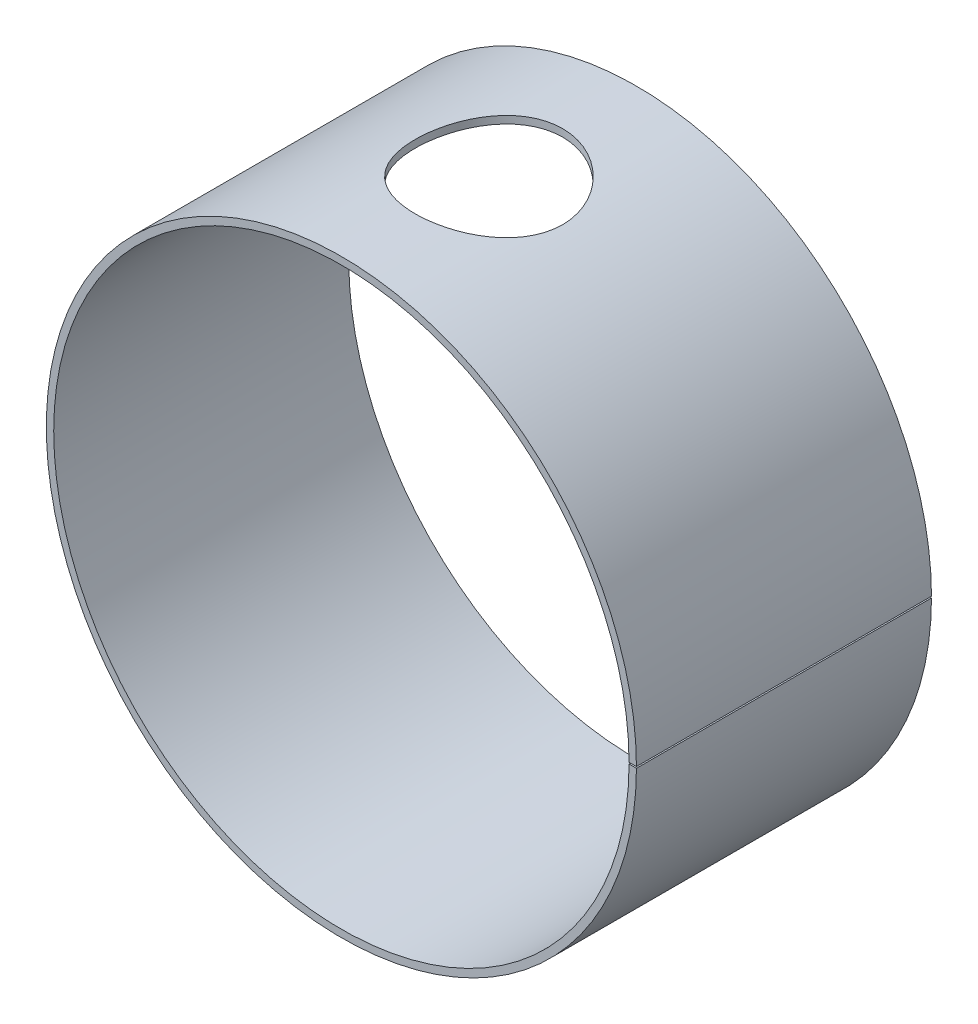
ISO-10303-21;
HEADER;
FILE_DESCRIPTION(('STEP AP214'),'2;1');
FILE_NAME('part.step','',(''),(''),'','','');
FILE_SCHEMA(('AUTOMOTIVE_DESIGN { 1 0 10303 214 1 1 1 1 }'));
ENDSEC;
DATA;
#1=APPLICATION_CONTEXT('core data for automotive mechanical design processes');
#2=APPLICATION_PROTOCOL_DEFINITION('international standard','automotive_design',2000,#1);
#3=PRODUCT_CONTEXT('',#1,'mechanical');
#4=PRODUCT('Part','Part','',(#3));
#5=PRODUCT_RELATED_PRODUCT_CATEGORY('part','',(#4));
#6=PRODUCT_DEFINITION_FORMATION('','',#4);
#7=PRODUCT_DEFINITION_CONTEXT('part definition',#1,'design');
#8=PRODUCT_DEFINITION('design','',#6,#7);
#9=PRODUCT_DEFINITION_SHAPE('','',#8);
#10=(LENGTH_UNIT() NAMED_UNIT(*) SI_UNIT(.MILLI.,.METRE.));
#11=(NAMED_UNIT(*) PLANE_ANGLE_UNIT() SI_UNIT($,.RADIAN.));
#12=(NAMED_UNIT(*) SI_UNIT($,.STERADIAN.) SOLID_ANGLE_UNIT());
#13=UNCERTAINTY_MEASURE_WITH_UNIT(LENGTH_MEASURE(1.E-05),#10,'distance_accuracy_value','');
#14=(GEOMETRIC_REPRESENTATION_CONTEXT(3) GLOBAL_UNCERTAINTY_ASSIGNED_CONTEXT((#13)) GLOBAL_UNIT_ASSIGNED_CONTEXT((#10,
#11,#12)) REPRESENTATION_CONTEXT('',''));
#15=CARTESIAN_POINT('',(0.,0.,0.));
#16=DIRECTION('',(0.,0.,1.));
#17=DIRECTION('',(1.,0.,0.));
#18=AXIS2_PLACEMENT_3D('',#15,#16,#17);
#19=CARTESIAN_POINT('',(0.,0.,291.200490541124));
#20=DIRECTION('',(0.,0.,-1.));
#21=DIRECTION('',(-1.,0.,0.));
#22=AXIS2_PLACEMENT_3D('',#19,#20,#21);
#23=CYLINDRICAL_SURFACE('',#22,40.);
#24=DIRECTION('',(0.,0.,-1.));
#25=VECTOR('',#24,1.);
#26=CARTESIAN_POINT('',(39.9998749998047,-0.0999999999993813,291.200490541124));
#27=LINE('',#26,#25);
#28=CARTESIAN_POINT('',(39.9998749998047,-0.0999999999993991,40.0000000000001));
#29=VERTEX_POINT('',#28);
#30=CARTESIAN_POINT('',(39.9998749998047,-0.0999999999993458,1.11022302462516E-13));
#31=VERTEX_POINT('',#30);
#32=EDGE_CURVE('E407',#29,#31,#27,.T.);
#33=ORIENTED_EDGE('',*,*,#32,.F.);
#34=CARTESIAN_POINT('',(0.,0.,40.0000000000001));
#35=DIRECTION('',(0.,0.,-1.));
#36=DIRECTION('',(-1.,0.,0.));
#37=AXIS2_PLACEMENT_3D('',#34,#35,#36);
#38=CIRCLE('',#37,40.);
#39=CARTESIAN_POINT('',(39.9998749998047,0.0999999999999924,40.0000000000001));
#40=VERTEX_POINT('',#39);
#41=EDGE_CURVE('E436',#40,#29,#38,.F.);
#42=ORIENTED_EDGE('',*,*,#41,.F.);
#43=DIRECTION('',(0.,0.,-1.));
#44=VECTOR('',#43,1.);
#45=CARTESIAN_POINT('',(39.9998749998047,0.0999999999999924,291.200490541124));
#46=LINE('',#45,#44);
#47=CARTESIAN_POINT('',(39.9998749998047,0.0999999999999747,1.11022302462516E-13));
#48=VERTEX_POINT('',#47);
#49=EDGE_CURVE('E427',#48,#40,#46,.F.);
#50=ORIENTED_EDGE('',*,*,#49,.F.);
#51=CARTESIAN_POINT('',(0.,0.,1.11022302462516E-13));
#52=DIRECTION('',(0.,0.,-1.));
#53=DIRECTION('',(-1.,0.,0.));
#54=AXIS2_PLACEMENT_3D('',#51,#52,#53);
#55=CIRCLE('',#54,40.);
#56=EDGE_CURVE('E425',#31,#48,#55,.T.);
#57=ORIENTED_EDGE('',*,*,#56,.F.);
#58=EDGE_LOOP('',(#33,#42,#50,#57));
#59=FACE_BOUND('',#58,.T.);
#60=CARTESIAN_POINT('',(10.,38.7298334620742,20.));
#61=CARTESIAN_POINT('',(9.99999882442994,38.7298341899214,20.2761247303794));
#62=CARTESIAN_POINT('',(9.98855350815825,38.7327944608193,20.5522729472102));
#63=CARTESIAN_POINT('',(9.94286631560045,38.7445474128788,21.1025695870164));
#64=CARTESIAN_POINT('',(9.90862182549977,38.7533407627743,21.3767177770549));
#65=CARTESIAN_POINT('',(9.81760607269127,38.7764982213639,21.9211501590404));
#66=CARTESIAN_POINT('',(9.76082365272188,38.7908650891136,22.1914323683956));
#67=CARTESIAN_POINT('',(9.62520453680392,38.8247384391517,22.7260782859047));
#68=CARTESIAN_POINT('',(9.5463672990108,38.844245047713,22.9904418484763));
#69=CARTESIAN_POINT('',(9.36739293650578,38.887792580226,23.5110713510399));
#70=CARTESIAN_POINT('',(9.26728433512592,38.9118274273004,23.7673476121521));
#71=CARTESIAN_POINT('',(9.04647193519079,38.963754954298,24.2704587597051));
#72=CARTESIAN_POINT('',(8.92576802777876,38.9916476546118,24.5172935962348));
#73=CARTESIAN_POINT('',(8.6646679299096,39.0504984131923,24.9998784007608));
#74=CARTESIAN_POINT('',(8.5242749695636,39.081455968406,25.2356301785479));
#75=CARTESIAN_POINT('',(8.22470570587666,39.1455959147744,25.6946784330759));
#76=CARTESIAN_POINT('',(8.06552267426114,39.1787791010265,25.9179704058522));
#77=CARTESIAN_POINT('',(7.72620281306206,39.2471185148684,26.3548220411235));
#78=CARTESIAN_POINT('',(7.54571867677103,39.2823005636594,26.5681079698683));
#79=CARTESIAN_POINT('',(7.16749556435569,39.3530688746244,26.9788963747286));
#80=CARTESIAN_POINT('',(6.96974874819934,39.3886553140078,27.1763916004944));
#81=CARTESIAN_POINT('',(6.55834550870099,39.4592404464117,27.5542114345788));
#82=CARTESIAN_POINT('',(6.34468754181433,39.4942390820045,27.7345343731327));
#83=CARTESIAN_POINT('',(5.90296918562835,39.5626701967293,28.0766927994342));
#84=CARTESIAN_POINT('',(5.67491535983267,39.5961033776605,28.2385366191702));
#85=CARTESIAN_POINT('',(5.20241798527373,39.6609696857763,28.544896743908));
#86=CARTESIAN_POINT('',(4.95778544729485,39.6923669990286,28.6891293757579));
#87=CARTESIAN_POINT('',(4.45690914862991,39.7517235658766,28.956366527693));
#88=CARTESIAN_POINT('',(4.20066995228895,39.7796841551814,29.0793793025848));
#89=CARTESIAN_POINT('',(3.67826123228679,39.8313856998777,29.3032876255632));
#90=CARTESIAN_POINT('',(3.41209084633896,39.8551262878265,29.4041812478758));
#91=CARTESIAN_POINT('',(2.87176268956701,39.8976992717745,29.5830035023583));
#92=CARTESIAN_POINT('',(2.59760510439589,39.916531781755,29.6609326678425));
#93=CARTESIAN_POINT('',(2.04895085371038,39.9484139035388,29.7918190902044));
#94=CARTESIAN_POINT('',(1.77457355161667,39.9615729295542,29.8452502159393));
#95=CARTESIAN_POINT('',(1.22210094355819,39.9822820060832,29.9289739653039));
#96=CARTESIAN_POINT('',(0.944005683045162,39.9898321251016,29.9592668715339));
#97=CARTESIAN_POINT('',(0.386193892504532,39.9991081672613,29.9964483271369));
#98=CARTESIAN_POINT('',(0.106477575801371,40.0008348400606,30.0033398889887));
#99=CARTESIAN_POINT('',(-0.452521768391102,39.9984167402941,29.993666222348));
#100=CARTESIAN_POINT('',(-0.73180480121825,39.9942720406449,29.977101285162));
#101=CARTESIAN_POINT('',(-1.28167192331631,39.9803861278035,29.9212893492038));
#102=CARTESIAN_POINT('',(-1.55231139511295,39.970771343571,29.8825546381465));
#103=CARTESIAN_POINT('',(-2.08927819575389,39.9463033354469,29.7831216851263));
#104=CARTESIAN_POINT('',(-2.35560559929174,39.9314502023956,29.7224238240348));
#105=CARTESIAN_POINT('',(-2.88207226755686,39.8969077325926,29.5795639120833));
#106=CARTESIAN_POINT('',(-3.14221243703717,39.8772191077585,29.4974050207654));
#107=CARTESIAN_POINT('',(-3.65468922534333,39.8335212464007,29.3122235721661));
#108=CARTESIAN_POINT('',(-3.90702288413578,39.8095103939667,29.2091932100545));
#109=CARTESIAN_POINT('',(-4.40431534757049,39.7575786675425,28.9820591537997));
#110=CARTESIAN_POINT('',(-4.64918953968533,39.7296251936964,28.8577777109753));
#111=CARTESIAN_POINT('',(-5.12762994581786,39.670713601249,28.5896805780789));
#112=CARTESIAN_POINT('',(-5.36119566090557,39.6397553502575,28.4458640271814));
#113=CARTESIAN_POINT('',(-5.81555504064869,39.5756487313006,28.1396791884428));
#114=CARTESIAN_POINT('',(-6.03634710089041,39.54250008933,27.9773085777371));
#115=CARTESIAN_POINT('',(-6.4637475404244,39.4748880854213,27.6351106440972));
#116=CARTESIAN_POINT('',(-6.67035566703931,39.440424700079,27.4552830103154));
#117=CARTESIAN_POINT('',(-7.07349089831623,39.3701501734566,27.0742295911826));
#118=CARTESIAN_POINT('',(-7.26959292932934,39.3343278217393,26.8725559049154));
#119=CARTESIAN_POINT('',(-7.64415900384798,39.2632548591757,26.4533588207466));
#120=CARTESIAN_POINT('',(-7.82262331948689,39.228004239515,26.2358356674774));
#121=CARTESIAN_POINT('',(-8.16074569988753,39.1590604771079,25.786307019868));
#122=CARTESIAN_POINT('',(-8.32039882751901,39.1253677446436,25.5542977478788));
#123=CARTESIAN_POINT('',(-8.61965464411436,39.0605298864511,25.0774748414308));
#124=CARTESIAN_POINT('',(-8.75926505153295,39.0293837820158,24.8326661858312));
#125=CARTESIAN_POINT('',(-9.01813008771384,38.9703868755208,24.3305332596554));
#126=CARTESIAN_POINT('',(-9.13727778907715,38.9425536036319,24.0731517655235));
#127=CARTESIAN_POINT('',(-9.35340966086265,38.8912082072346,23.5488215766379));
#128=CARTESIAN_POINT('',(-9.45039369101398,38.8676961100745,23.2818728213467));
#129=CARTESIAN_POINT('',(-9.6213797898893,38.8257235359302,22.7403739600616));
#130=CARTESIAN_POINT('',(-9.69538588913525,38.8072621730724,22.4658251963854));
#131=CARTESIAN_POINT('',(-9.81979727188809,38.7759681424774,21.9111173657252));
#132=CARTESIAN_POINT('',(-9.87020317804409,38.7631353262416,21.6309584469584));
#133=CARTESIAN_POINT('',(-9.94595070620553,38.7437678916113,21.0746101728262));
#134=CARTESIAN_POINT('',(-9.97191943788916,38.7370758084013,20.7985115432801));
#135=CARTESIAN_POINT('',(-10.0008373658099,38.7296201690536,20.2450332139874));
#136=CARTESIAN_POINT('',(-10.0037869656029,38.7288565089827,19.9676535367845));
#137=CARTESIAN_POINT('',(-9.9866420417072,38.7332810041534,19.4136800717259));
#138=CARTESIAN_POINT('',(-9.96654947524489,38.7384686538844,19.1370862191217));
#139=CARTESIAN_POINT('',(-9.90349851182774,38.7546355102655,18.5866903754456));
#140=CARTESIAN_POINT('',(-9.86054021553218,38.7656146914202,18.3128883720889));
#141=CARTESIAN_POINT('',(-9.75302617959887,38.7928020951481,17.7745633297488));
#142=CARTESIAN_POINT('',(-9.6888404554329,38.808920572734,17.5099617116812));
#143=CARTESIAN_POINT('',(-9.53919991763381,38.8459727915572,16.9870878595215));
#144=CARTESIAN_POINT('',(-9.45373745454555,38.8669082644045,16.7288179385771));
#145=CARTESIAN_POINT('',(-9.26222456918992,38.9129912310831,16.2204540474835));
#146=CARTESIAN_POINT('',(-9.15617645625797,38.938138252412,15.9703591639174));
#147=CARTESIAN_POINT('',(-8.92426167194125,38.9919442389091,15.4799182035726));
#148=CARTESIAN_POINT('',(-8.79839403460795,39.020603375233,15.2395726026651));
#149=CARTESIAN_POINT('',(-8.52507025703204,39.0812377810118,14.7655480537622));
#150=CARTESIAN_POINT('',(-8.37723937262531,39.113267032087,14.5320920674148));
#151=CARTESIAN_POINT('',(-8.0629212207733,39.1792684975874,14.0783899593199));
#152=CARTESIAN_POINT('',(-7.89643375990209,39.213240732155,13.8581439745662));
#153=CARTESIAN_POINT('',(-7.54588651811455,39.2822033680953,13.432224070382));
#154=CARTESIAN_POINT('',(-7.3618240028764,39.3171939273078,13.2265524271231));
#155=CARTESIAN_POINT('',(-6.97734499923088,39.3872419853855,12.8311295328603));
#156=CARTESIAN_POINT('',(-6.77692868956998,39.4222994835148,12.6413781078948));
#157=CARTESIAN_POINT('',(-6.35575426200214,39.492418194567,12.2744352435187));
#158=CARTESIAN_POINT('',(-6.13461012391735,39.5274571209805,12.0976822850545));
#159=CARTESIAN_POINT('',(-5.67802548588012,39.5956219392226,11.76349371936));
#160=CARTESIAN_POINT('',(-5.44259023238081,39.6287485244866,11.6060510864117));
#161=CARTESIAN_POINT('',(-4.9588919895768,39.6921766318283,11.311526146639));
#162=CARTESIAN_POINT('',(-4.71062694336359,39.7224776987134,11.1744471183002));
#163=CARTESIAN_POINT('',(-4.20300973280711,39.7793907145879,10.9217242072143));
#164=CARTESIAN_POINT('',(-3.94365773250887,39.8060027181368,10.8060800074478));
#165=CARTESIAN_POINT('',(-3.41762467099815,39.8545993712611,10.5979116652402));
#166=CARTESIAN_POINT('',(-3.15101114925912,39.8766164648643,10.505224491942));
#167=CARTESIAN_POINT('',(-2.6105610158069,39.9156405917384,10.3426402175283));
#168=CARTESIAN_POINT('',(-2.33672441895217,39.9326476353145,10.2727430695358));
#169=CARTESIAN_POINT('',(-1.78388474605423,39.9611605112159,10.1563453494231));
#170=CARTESIAN_POINT('',(-1.50488250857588,39.9726672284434,10.1098410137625));
#171=CARTESIAN_POINT('',(-0.943766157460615,39.989849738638,10.0406219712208));
#172=CARTESIAN_POINT('',(-0.661652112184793,39.9955256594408,10.0179067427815));
#173=CARTESIAN_POINT('',(-0.104112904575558,40.0008096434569,9.99675707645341));
#174=CARTESIAN_POINT('',(0.171286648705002,40.0005777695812,9.99768214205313));
#175=CARTESIAN_POINT('',(0.721004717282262,39.9944459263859,10.022232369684));
#176=CARTESIAN_POINT('',(0.995323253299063,39.9885460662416,10.0458570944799));
#177=CARTESIAN_POINT('',(1.54089668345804,39.9712412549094,10.1156049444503));
#178=CARTESIAN_POINT('',(1.8121516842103,39.9598364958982,10.1617272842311));
#179=CARTESIAN_POINT('',(2.34968444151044,39.9318346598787,10.276086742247));
#180=CARTESIAN_POINT('',(2.61596217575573,39.9152375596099,10.3443239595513));
#181=CARTESIAN_POINT('',(3.14021575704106,39.8774088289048,10.5019187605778));
#182=CARTESIAN_POINT('',(3.39822973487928,39.8562036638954,10.591155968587));
#183=CARTESIAN_POINT('',(3.90587165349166,39.8096616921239,10.7903021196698));
#184=CARTESIAN_POINT('',(4.15549652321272,39.7843233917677,10.9002185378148));
#185=CARTESIAN_POINT('',(4.644612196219,39.7301915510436,11.1398792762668));
#186=CARTESIAN_POINT('',(4.88410403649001,39.7013983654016,11.2696215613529));
#187=CARTESIAN_POINT('',(5.35147219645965,39.6411058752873,11.5480334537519));
#188=CARTESIAN_POINT('',(5.57934796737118,39.6096064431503,11.6967039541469));
#189=CARTESIAN_POINT('',(6.02736320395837,39.5439423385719,12.01574564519));
#190=CARTESIAN_POINT('',(6.24718667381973,39.5097319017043,12.1865512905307));
#191=CARTESIAN_POINT('',(6.67174267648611,39.4402602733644,12.5457945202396));
#192=CARTESIAN_POINT('',(6.87647499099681,39.404999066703,12.7342323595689));
#193=CARTESIAN_POINT('',(7.26957571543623,39.3343764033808,13.1275481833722));
#194=CARTESIAN_POINT('',(7.45793992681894,39.2990149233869,13.3324303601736));
#195=CARTESIAN_POINT('',(7.81700480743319,39.2291715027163,13.7572612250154));
#196=CARTESIAN_POINT('',(7.98770582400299,39.1946895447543,13.9772096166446));
#197=CARTESIAN_POINT('',(8.3133483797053,39.1269271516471,14.4350529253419));
#198=CARTESIAN_POINT('',(8.4679310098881,39.0936817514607,14.6732084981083));
#199=CARTESIAN_POINT('',(8.75638447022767,39.0300851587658,15.1620014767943));
#200=CARTESIAN_POINT('',(8.89026288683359,38.9997329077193,15.4126342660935));
#201=CARTESIAN_POINT('',(9.13629742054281,38.9428300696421,15.9246223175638));
#202=CARTESIAN_POINT('',(9.24846310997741,38.9162778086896,16.1859727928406));
#203=CARTESIAN_POINT('',(9.45023169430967,38.8677746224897,16.7176328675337));
#204=CARTESIAN_POINT('',(9.53983802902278,38.8458229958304,16.9879410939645));
#205=CARTESIAN_POINT('',(9.68099536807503,38.8108560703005,17.483727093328));
#206=CARTESIAN_POINT('',(9.73653858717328,38.7969358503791,17.7080140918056));
#207=CARTESIAN_POINT('',(9.83199198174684,38.7728560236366,18.1600842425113));
#208=CARTESIAN_POINT('',(9.87190326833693,38.7626961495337,18.3878671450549));
#209=CARTESIAN_POINT('',(9.93585968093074,38.746351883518,18.8458127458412));
#210=CARTESIAN_POINT('',(9.95990338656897,38.7401678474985,19.0759756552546));
#211=CARTESIAN_POINT('',(9.99197195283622,38.7319088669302,19.5374204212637));
#212=CARTESIAN_POINT('',(10.0000009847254,38.7298328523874,19.7687019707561));
#213=CARTESIAN_POINT('',(10.,38.7298334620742,20.));
#214=B_SPLINE_CURVE_WITH_KNOTS('',3,(#60,#61,#62,#63,#64,#65,#66,#67,#68,#69,#70,#71,#72,#73,
#74,#75,#76,#77,#78,#79,#80,#81,#82,#83,#84,#85,#86,#87,#88,#89,#90,#91,#92,#93,#94,#95,#96,#97,
#98,#99,#100,#101,#102,#103,#104,#105,#106,#107,#108,#109,#110,#111,#112,#113,#114,#115,#116,
#117,#118,#119,#120,#121,#122,#123,#124,#125,#126,#127,#128,#129,#130,#131,#132,#133,#134,#135,
#136,#137,#138,#139,#140,#141,#142,#143,#144,#145,#146,#147,#148,#149,#150,#151,#152,#153,#154,
#155,#156,#157,#158,#159,#160,#161,#162,#163,#164,#165,#166,#167,#168,#169,#170,#171,#172,#173,
#174,#175,#176,#177,#178,#179,#180,#181,#182,#183,#184,#185,#186,#187,#188,#189,#190,#191,#192,
#193,#194,#195,#196,#197,#198,#199,#200,#201,#202,#203,#204,#205,#206,#207,#208,#209,#210,#211,
#212,#213),.UNSPECIFIED.,.T.,.F.,(4,2,2,2,2,2,2,2,2,2,2,2,2,2,2,2,2,2,2,2,2,2,2,2,2,2,2,2,2,2,2,
2,2,2,2,2,2,2,2,2,2,2,2,2,2,2,2,2,2,2,2,2,2,2,2,2,2,2,2,2,2,2,2,2,2,2,2,2,2,2,2,2,2,2,2,2,4),
(0.,0.828162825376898,1.656420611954,2.48508893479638,3.31377761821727,4.14136202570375,
4.96895080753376,5.79640397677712,6.6241543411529,7.4680030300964,8.31223697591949,
9.15655292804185,10.0004866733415,10.8565959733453,11.7123714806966,12.5682214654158,
13.4240515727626,14.2625454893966,15.1010291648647,15.9394048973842,16.7777702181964,
17.5975029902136,18.4172215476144,19.2368194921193,20.0567244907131,20.8838566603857,
21.7110252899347,22.5382975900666,23.3655846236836,24.2152966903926,25.0649956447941,
25.9149171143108,26.7645103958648,27.6184163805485,28.472327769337,29.32608929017,
30.1798282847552,31.0110078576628,31.8421728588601,32.6732672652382,33.5043580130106,
34.3216649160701,35.1392660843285,35.9567755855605,36.7743249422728,37.6078964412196,
38.4414765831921,39.2751866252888,40.108887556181,40.9636530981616,41.8181067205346,
42.6726977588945,43.527276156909,44.3755994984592,45.2239210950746,46.0721061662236,
46.9202726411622,47.7454843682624,48.5706802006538,49.395847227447,50.2210179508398,
51.0415691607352,51.8624175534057,52.6831817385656,53.5039846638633,54.3444458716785,
55.1849192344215,56.0256075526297,56.8662793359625,57.7228427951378,58.5790916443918,
59.4349621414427,60.2907020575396,60.9845870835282,61.6784227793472,62.3723205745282,
63.066037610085),.UNSPECIFIED.);
#215=CARTESIAN_POINT('',(10.,38.7298334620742,20.));
#216=VERTEX_POINT('',#215);
#217=EDGE_CURVE('E419',#216,#216,#214,.T.);
#218=ORIENTED_EDGE('',*,*,#217,.T.);
#219=EDGE_LOOP('',(#218));
#220=FACE_BOUND('',#219,.T.);
#221=ADVANCED_FACE('F358',(#59,#220),#23,.T.);
#222=CARTESIAN_POINT('',(0.,0.,291.200490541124));
#223=DIRECTION('',(0.,0.,-1.));
#224=DIRECTION('',(-1.,0.,0.));
#225=AXIS2_PLACEMENT_3D('',#222,#223,#224);
#226=CYLINDRICAL_SURFACE('',#225,39.);
#227=DIRECTION('',(0.,0.,-1.));
#228=VECTOR('',#227,1.);
#229=CARTESIAN_POINT('',(38.9998781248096,-0.0974999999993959,291.200490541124));
#230=LINE('',#229,#228);
#231=CARTESIAN_POINT('',(38.9998781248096,-0.0974999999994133,40.0000000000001));
#232=VERTEX_POINT('',#231);
#233=CARTESIAN_POINT('',(38.9998781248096,-0.0974999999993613,1.11022302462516E-13));
#234=VERTEX_POINT('',#233);
#235=EDGE_CURVE('E405',#232,#234,#230,.T.);
#236=ORIENTED_EDGE('',*,*,#235,.T.);
#237=CARTESIAN_POINT('',(0.,0.,1.11022302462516E-13));
#238=DIRECTION('',(0.,0.,-1.));
#239=DIRECTION('',(-1.,0.,0.));
#240=AXIS2_PLACEMENT_3D('',#237,#238,#239);
#241=CIRCLE('',#240,39.);
#242=CARTESIAN_POINT('',(38.9998781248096,0.0974999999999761,1.11022302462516E-13));
#243=VERTEX_POINT('',#242);
#244=EDGE_CURVE('E413',#234,#243,#241,.T.);
#245=ORIENTED_EDGE('',*,*,#244,.T.);
#246=DIRECTION('',(0.,0.,-1.));
#247=VECTOR('',#246,1.);
#248=CARTESIAN_POINT('',(38.9998781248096,0.0974999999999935,291.200490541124));
#249=LINE('',#248,#247);
#250=CARTESIAN_POINT('',(38.9998781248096,0.0974999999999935,40.0000000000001));
#251=VERTEX_POINT('',#250);
#252=EDGE_CURVE('E418',#243,#251,#249,.F.);
#253=ORIENTED_EDGE('',*,*,#252,.T.);
#254=CARTESIAN_POINT('',(0.,0.,40.0000000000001));
#255=DIRECTION('',(0.,0.,-1.));
#256=DIRECTION('',(-1.,0.,0.));
#257=AXIS2_PLACEMENT_3D('',#254,#255,#256);
#258=CIRCLE('',#257,39.);
#259=EDGE_CURVE('E424',#251,#232,#258,.F.);
#260=ORIENTED_EDGE('',*,*,#259,.T.);
#261=EDGE_LOOP('',(#236,#245,#253,#260));
#262=FACE_BOUND('',#261,.T.);
#263=CARTESIAN_POINT('',(10.,37.6961536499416,20.));
#264=CARTESIAN_POINT('',(9.9999988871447,37.6961543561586,20.2758740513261));
#265=CARTESIAN_POINT('',(9.98857429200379,37.6991903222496,20.5517699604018));
#266=CARTESIAN_POINT('',(9.94297112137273,37.711243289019,21.1015592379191));
#267=CARTESIAN_POINT('',(9.90879011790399,37.7202609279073,21.3754523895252));
#268=CARTESIAN_POINT('',(9.81794749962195,37.7440075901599,21.9193652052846));
#269=CARTESIAN_POINT('',(9.76127537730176,37.7587392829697,22.189382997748));
#270=CARTESIAN_POINT('',(9.62592579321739,37.7934706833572,22.7235011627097));
#271=CARTESIAN_POINT('',(9.54724777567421,37.813470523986,22.9876013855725));
#272=CARTESIAN_POINT('',(9.3686471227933,37.8581154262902,23.5076984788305));
#273=CARTESIAN_POINT('',(9.26875389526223,37.8827540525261,23.7637060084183));
#274=CARTESIAN_POINT('',(9.04842686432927,37.9359830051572,24.2662933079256));
#275=CARTESIAN_POINT('',(8.92799296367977,37.9645733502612,24.5128730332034));
#276=CARTESIAN_POINT('',(8.66748503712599,38.0248940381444,24.9949739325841));
#277=CARTESIAN_POINT('',(8.52741399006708,38.0566239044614,25.2304967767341));
#278=CARTESIAN_POINT('',(8.22853874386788,38.1223630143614,25.6891207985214));
#279=CARTESIAN_POINT('',(8.06972782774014,38.156373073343,25.9122174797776));
#280=CARTESIAN_POINT('',(7.73102984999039,38.2264526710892,26.3489442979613));
#281=CARTESIAN_POINT('',(7.5507776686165,38.2625501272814,26.562286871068));
#282=CARTESIAN_POINT('',(7.17302175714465,38.3351634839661,26.9732120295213));
#283=CARTESIAN_POINT('',(6.97551018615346,38.3716795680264,27.1707873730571));
#284=CARTESIAN_POINT('',(6.56457254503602,38.4441141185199,27.5487968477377));
#285=CARTESIAN_POINT('',(6.35114486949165,38.4800325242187,27.7292292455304));
#286=CARTESIAN_POINT('',(5.90987445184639,38.5502693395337,28.0716379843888));
#287=CARTESIAN_POINT('',(5.68203827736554,38.5845884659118,28.2336226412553));
#288=CARTESIAN_POINT('',(5.20977554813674,38.6512089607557,28.5404171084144));
#289=CARTESIAN_POINT('',(4.96514940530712,38.6834717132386,28.6849283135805));
#290=CARTESIAN_POINT('',(4.46423990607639,38.7444729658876,28.9527194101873));
#291=CARTESIAN_POINT('',(4.20796114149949,38.773212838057,29.07600757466));
#292=CARTESIAN_POINT('',(3.68542692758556,38.8263646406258,29.3004563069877));
#293=CARTESIAN_POINT('',(3.41917066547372,38.8507762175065,29.4016150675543));
#294=CARTESIAN_POINT('',(2.87862488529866,38.8945630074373,29.5809498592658));
#295=CARTESIAN_POINT('',(2.60433556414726,38.9139383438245,29.6591264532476));
#296=CARTESIAN_POINT('',(2.0556582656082,38.9467352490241,29.7904106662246));
#297=CARTESIAN_POINT('',(1.78139635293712,38.9602746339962,29.8440159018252));
#298=CARTESIAN_POINT('',(1.22912862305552,38.981605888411,29.9281043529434));
#299=CARTESIAN_POINT('',(0.951122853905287,38.9893978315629,29.9585878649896));
#300=CARTESIAN_POINT('',(0.393469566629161,38.9990120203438,29.99616272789));
#301=CARTESIAN_POINT('',(0.113822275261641,39.0008350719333,30.0032572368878));
#302=CARTESIAN_POINT('',(-0.445056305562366,38.9984616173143,29.9939996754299));
#303=CARTESIAN_POINT('',(-0.724287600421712,38.9942651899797,29.9776479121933));
#304=CARTESIAN_POINT('',(-1.27374604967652,38.9801402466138,29.922299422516));
#305=CARTESIAN_POINT('',(-1.54403112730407,38.9703479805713,29.8838408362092));
#306=CARTESIAN_POINT('',(-2.08030944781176,38.945402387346,29.7850217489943));
#307=CARTESIAN_POINT('',(-2.34630276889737,38.9302491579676,29.7246616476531));
#308=CARTESIAN_POINT('',(-2.87212632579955,38.8949909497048,29.5825390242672));
#309=CARTESIAN_POINT('',(-3.13195745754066,38.8748866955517,29.500779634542));
#310=CARTESIAN_POINT('',(-3.64384697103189,38.8302513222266,29.3164591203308));
#311=CARTESIAN_POINT('',(-3.89590240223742,38.8057185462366,29.2138902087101));
#312=CARTESIAN_POINT('',(-4.39276091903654,38.7526341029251,28.9877049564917));
#313=CARTESIAN_POINT('',(-4.63747639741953,38.7240476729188,28.863904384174));
#314=CARTESIAN_POINT('',(-5.11564042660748,38.6637854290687,28.5968147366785));
#315=CARTESIAN_POINT('',(-5.34908846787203,38.6321094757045,28.453524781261));
#316=CARTESIAN_POINT('',(-5.80326396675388,38.5664982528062,28.1484339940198));
#317=CARTESIAN_POINT('',(-6.02398974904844,38.5325626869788,27.9866307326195));
#318=CARTESIAN_POINT('',(-6.45131741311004,38.4633249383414,27.6456023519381));
#319=CARTESIAN_POINT('',(-6.65791903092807,38.4280227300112,27.4663769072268));
#320=CARTESIAN_POINT('',(-7.06138475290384,38.3559647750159,27.0863123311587));
#321=CARTESIAN_POINT('',(-7.25780390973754,38.319196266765,26.8850029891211));
#322=CARTESIAN_POINT('',(-7.63303689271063,38.2462192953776,26.4665085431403));
#323=CARTESIAN_POINT('',(-7.81185098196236,38.210010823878,26.2493236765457));
#324=CARTESIAN_POINT('',(-8.15070826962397,38.1391653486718,25.8004357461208));
#325=CARTESIAN_POINT('',(-8.31074643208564,38.1045287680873,25.5687288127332));
#326=CARTESIAN_POINT('',(-8.6108051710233,38.0378450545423,25.0924667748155));
#327=CARTESIAN_POINT('',(-8.75083346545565,38.0057969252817,24.8479166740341));
#328=CARTESIAN_POINT('',(-9.01062817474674,37.9450456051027,24.3461293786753));
#329=CARTESIAN_POINT('',(-9.13027766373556,37.9163619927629,24.0888292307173));
#330=CARTESIAN_POINT('',(-9.34741454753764,37.8634169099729,23.5645942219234));
#331=CARTESIAN_POINT('',(-9.4449017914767,37.8391554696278,23.297659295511));
#332=CARTESIAN_POINT('',(-9.6168850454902,37.7958118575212,22.7561232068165));
#333=CARTESIAN_POINT('',(-9.69138532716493,37.7767287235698,22.4815234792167));
#334=CARTESIAN_POINT('',(-9.81676694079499,37.7443411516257,21.9266501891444));
#335=CARTESIAN_POINT('',(-9.86764893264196,37.7310365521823,21.646376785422));
#336=CARTESIAN_POINT('',(-9.94425798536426,37.7109169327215,21.0901184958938));
#337=CARTESIAN_POINT('',(-9.97064366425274,37.703932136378,20.8142303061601));
#338=CARTESIAN_POINT('',(-10.0004253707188,37.6960440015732,20.2611308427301));
#339=CARTESIAN_POINT('',(-10.0038218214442,37.6951405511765,19.9839195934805));
#340=CARTESIAN_POINT('',(-9.98759627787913,37.6994428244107,19.4302456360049));
#341=CARTESIAN_POINT('',(-9.96797634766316,37.7046480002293,19.1537828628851));
#342=CARTESIAN_POINT('',(-9.90589423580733,37.7210059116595,18.6036141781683));
#343=CARTESIAN_POINT('',(-9.86343216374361,37.7321586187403,18.3299082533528));
#344=CARTESIAN_POINT('',(-9.75698219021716,37.759823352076,17.7920298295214));
#345=CARTESIAN_POINT('',(-9.6933873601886,37.7762373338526,17.527774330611));
#346=CARTESIAN_POINT('',(-9.54499662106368,37.8140039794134,17.0055464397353));
#347=CARTESIAN_POINT('',(-9.46019309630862,37.8353584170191,16.7475763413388));
#348=CARTESIAN_POINT('',(-9.27006360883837,37.8823903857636,16.2397577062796));
#349=CARTESIAN_POINT('',(-9.16473988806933,37.9080674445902,15.9899082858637));
#350=CARTESIAN_POINT('',(-8.93433628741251,37.9630300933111,15.4998953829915));
#351=CARTESIAN_POINT('',(-8.80925541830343,37.992315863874,15.2597323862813));
#352=CARTESIAN_POINT('',(-8.53745710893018,38.0543249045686,14.7857914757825));
#353=CARTESIAN_POINT('',(-8.39034871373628,38.0871063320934,14.5522453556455));
#354=CARTESIAN_POINT('',(-8.07749479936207,38.1546809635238,14.0982995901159));
#355=CARTESIAN_POINT('',(-7.91174907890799,38.1894741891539,13.8779000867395));
#356=CARTESIAN_POINT('',(-7.56269531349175,38.2601273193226,13.4515998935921));
#357=CARTESIAN_POINT('',(-7.37938440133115,38.2959873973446,13.2457015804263));
#358=CARTESIAN_POINT('',(-6.99640905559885,38.3678017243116,12.8497465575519));
#359=CARTESIAN_POINT('',(-6.79674478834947,38.4037559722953,12.6596896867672));
#360=CARTESIAN_POINT('',(-6.37677976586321,38.4757489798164,12.2917786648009));
#361=CARTESIAN_POINT('',(-6.15607015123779,38.5117643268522,12.1143862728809));
#362=CARTESIAN_POINT('',(-5.70028820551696,38.5818590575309,11.7788832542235));
#363=CARTESIAN_POINT('',(-5.46522113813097,38.615939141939,11.620765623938));
#364=CARTESIAN_POINT('',(-4.98218476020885,38.6812258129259,11.3248592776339));
#365=CARTESIAN_POINT('',(-4.7342133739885,38.7124319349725,11.1870738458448));
#366=CARTESIAN_POINT('',(-4.22710231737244,38.7710812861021,10.9329143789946));
#367=CARTESIAN_POINT('',(-3.96796281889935,38.7985245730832,10.8165400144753));
#368=CARTESIAN_POINT('',(-3.44230162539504,38.8486774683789,10.6069160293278));
#369=CARTESIAN_POINT('',(-3.17584927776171,38.8714208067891,10.5135006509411));
#370=CARTESIAN_POINT('',(-2.6356378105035,38.9117818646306,10.3494510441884));
#371=CARTESIAN_POINT('',(-2.36187870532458,38.9293995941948,10.2788167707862));
#372=CARTESIAN_POINT('',(-1.80911481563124,38.9590001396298,10.1609477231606));
#373=CARTESIAN_POINT('',(-1.53011092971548,38.9709839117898,10.1137089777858));
#374=CARTESIAN_POINT('',(-0.968915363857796,38.9889729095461,10.0430335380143));
#375=CARTESIAN_POINT('',(-0.686723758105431,38.9949782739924,10.0195962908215));
#376=CARTESIAN_POINT('',(-0.129353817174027,39.0007529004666,9.9970585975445));
#377=CARTESIAN_POINT('',(0.145795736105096,39.0006946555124,9.99728498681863));
#378=CARTESIAN_POINT('',(0.695074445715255,38.9947727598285,10.0203993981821));
#379=CARTESIAN_POINT('',(0.969203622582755,38.9889092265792,10.0432869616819));
#380=CARTESIAN_POINT('',(1.51445710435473,38.9715386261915,10.111526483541));
#381=CARTESIAN_POINT('',(1.78558152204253,38.9600317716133,10.1568775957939));
#382=CARTESIAN_POINT('',(2.32291190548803,38.9316897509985,10.2696637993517));
#383=CARTESIAN_POINT('',(2.58911784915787,38.9148545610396,10.3370989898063));
#384=CARTESIAN_POINT('',(3.11314293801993,38.8764317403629,10.4930229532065));
#385=CARTESIAN_POINT('',(3.3710035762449,38.8548739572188,10.5813797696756));
#386=CARTESIAN_POINT('',(3.878409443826,38.8075108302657,10.7787165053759));
#387=CARTESIAN_POINT('',(4.12795163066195,38.7817039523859,10.8877038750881));
#388=CARTESIAN_POINT('',(4.61698015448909,38.7265289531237,11.1254629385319));
#389=CARTESIAN_POINT('',(4.85646748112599,38.6971611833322,11.2542326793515));
#390=CARTESIAN_POINT('',(5.32391187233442,38.6356253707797,11.5306612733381));
#391=CARTESIAN_POINT('',(5.55186837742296,38.6034571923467,11.6783210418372));
#392=CARTESIAN_POINT('',(6.00037219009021,38.5363235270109,11.9954490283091));
#393=CARTESIAN_POINT('',(6.22059200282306,38.5013082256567,12.1653700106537));
#394=CARTESIAN_POINT('',(6.64601690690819,38.4301572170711,12.5228575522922));
#395=CARTESIAN_POINT('',(6.85122177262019,38.3940214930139,12.7104243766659));
#396=CARTESIAN_POINT('',(7.24534953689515,38.321600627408,13.1020220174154));
#397=CARTESIAN_POINT('',(7.43426821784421,38.2853154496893,13.306057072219));
#398=CARTESIAN_POINT('',(7.7945271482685,38.2135982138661,13.729229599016));
#399=CARTESIAN_POINT('',(7.96586773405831,38.1781661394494,13.9483667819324));
#400=CARTESIAN_POINT('',(8.29309024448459,38.108440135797,14.4049033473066));
#401=CARTESIAN_POINT('',(8.44859122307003,38.0741835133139,14.6425816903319));
#402=CARTESIAN_POINT('',(8.73891795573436,38.0085972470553,15.1305161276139));
#403=CARTESIAN_POINT('',(8.8737512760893,37.9772665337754,15.3807675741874));
#404=CARTESIAN_POINT('',(9.12172670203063,37.9184696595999,15.8921038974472));
#405=CARTESIAN_POINT('',(9.23487780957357,37.8910018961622,16.1531842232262));
#406=CARTESIAN_POINT('',(9.43863318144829,37.8407615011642,16.6844148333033));
#407=CARTESIAN_POINT('',(9.52924074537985,37.8179881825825,16.9545637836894));
#408=CARTESIAN_POINT('',(9.67296904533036,37.781452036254,17.452785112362));
#409=CARTESIAN_POINT('',(9.72989959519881,37.7668055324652,17.6797023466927));
#410=CARTESIAN_POINT('',(9.82774578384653,37.7414622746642,18.1371759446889));
#411=CARTESIAN_POINT('',(9.86866254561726,37.7307652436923,18.367732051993));
#412=CARTESIAN_POINT('',(9.93423366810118,37.7135539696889,18.8313214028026));
#413=CARTESIAN_POINT('',(9.95888662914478,37.7070400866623,19.0643548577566));
#414=CARTESIAN_POINT('',(9.99176802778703,37.6983402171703,19.5315871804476));
#415=CARTESIAN_POINT('',(10.0000009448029,37.6961530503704,19.7657857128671));
#416=CARTESIAN_POINT('',(10.,37.6961536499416,20.));
#417=B_SPLINE_CURVE_WITH_KNOTS('',3,(#263,#264,#265,#266,#267,#268,#269,#270,#271,#272,#273,
#274,#275,#276,#277,#278,#279,#280,#281,#282,#283,#284,#285,#286,#287,#288,#289,#290,#291,#292,
#293,#294,#295,#296,#297,#298,#299,#300,#301,#302,#303,#304,#305,#306,#307,#308,#309,#310,#311,
#312,#313,#314,#315,#316,#317,#318,#319,#320,#321,#322,#323,#324,#325,#326,#327,#328,#329,#330,
#331,#332,#333,#334,#335,#336,#337,#338,#339,#340,#341,#342,#343,#344,#345,#346,#347,#348,#349,
#350,#351,#352,#353,#354,#355,#356,#357,#358,#359,#360,#361,#362,#363,#364,#365,#366,#367,#368,
#369,#370,#371,#372,#373,#374,#375,#376,#377,#378,#379,#380,#381,#382,#383,#384,#385,#386,#387,
#388,#389,#390,#391,#392,#393,#394,#395,#396,#397,#398,#399,#400,#401,#402,#403,#404,#405,#406,
#407,#408,#409,#410,#411,#412,#413,#414,#415,#416),.UNSPECIFIED.,.T.,.F.,(4,2,2,2,2,2,2,2,2,2,2,
2,2,2,2,2,2,2,2,2,2,2,2,2,2,2,2,2,2,2,2,2,2,2,2,2,2,2,2,2,2,2,2,2,2,2,2,2,2,2,2,2,2,2,2,2,2,2,2,
2,2,2,2,2,2,2,2,2,2,2,2,2,2,2,2,2,4),(0.,0.827407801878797,1.65490389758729,2.48278704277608,
3.31069109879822,4.13745494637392,4.96422270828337,5.79086518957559,6.61780487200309,
7.46168541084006,8.30595133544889,9.15030253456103,9.99427160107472,10.8510736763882,
11.7075409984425,12.5640782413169,13.4205945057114,14.2589018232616,15.0971983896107,
15.9353817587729,16.7735541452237,17.5921385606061,18.4107080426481,19.2291577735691,
20.0479143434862,20.8741725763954,21.7004681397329,22.5268722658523,23.353291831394,
24.2032496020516,25.0531946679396,25.9033671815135,26.7532108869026,27.6077774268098,
28.4623497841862,29.3167632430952,30.1711528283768,31.0018426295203,31.8325171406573,
32.6631171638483,33.4937132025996,34.309652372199,35.1258849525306,35.9420284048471,
36.7582127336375,37.5911273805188,38.4240510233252,39.2571108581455,40.0901622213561,
40.9454730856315,41.8004722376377,42.6556093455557,43.5107332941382,44.359489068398,
45.2082431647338,46.056853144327,46.9054434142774,47.7299004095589,48.5543407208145,
49.3787499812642,50.2031629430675,51.0225085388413,51.8421505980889,52.6617117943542,
53.4813127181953,54.3213946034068,55.1614891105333,56.00180052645,56.8420958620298,
57.6993188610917,58.5562272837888,59.412779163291,60.2692055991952,60.9718470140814,
61.6744391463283,62.3770917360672,63.0795526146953),.UNSPECIFIED.);
#418=CARTESIAN_POINT('',(10.,37.6961536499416,20.));
#419=VERTEX_POINT('',#418);
#420=EDGE_CURVE('E362',#419,#419,#417,.T.);
#421=ORIENTED_EDGE('',*,*,#420,.F.);
#422=EDGE_LOOP('',(#421));
#423=FACE_BOUND('',#422,.T.);
#424=ADVANCED_FACE('F422',(#262,#423),#226,.F.);
#425=CARTESIAN_POINT('',(39.4998765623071,0.0987500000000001,20.));
#426=DIRECTION('',(-0.00249999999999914,0.999996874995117,0.));
#427=DIRECTION('',(0.,0.,1.));
#428=AXIS2_PLACEMENT_3D('',#425,#426,#427);
#429=PLANE('',#428);
#430=DIRECTION('',(0.999996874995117,0.00249999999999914,0.));
#431=VECTOR('',#430,1.);
#432=CARTESIAN_POINT('',(39.4998765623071,0.0987500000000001,40.));
#433=LINE('',#432,#431);
#434=EDGE_CURVE('E12',#251,#40,#433,.T.);
#435=ORIENTED_EDGE('',*,*,#434,.F.);
#436=ORIENTED_EDGE('',*,*,#252,.F.);
#437=DIRECTION('',(0.999996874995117,0.00249999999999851,0.));
#438=VECTOR('',#437,1.);
#439=CARTESIAN_POINT('',(39.4998765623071,0.0987499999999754,0.));
#440=LINE('',#439,#438);
#441=EDGE_CURVE('E371',#243,#48,#440,.T.);
#442=ORIENTED_EDGE('',*,*,#441,.T.);
#443=ORIENTED_EDGE('',*,*,#49,.T.);
#444=EDGE_LOOP('',(#435,#436,#442,#443));
#445=FACE_BOUND('',#444,.T.);
#446=ADVANCED_FACE('F443',(#445),#429,.F.);
#447=CARTESIAN_POINT('',(0.,0.,0.));
#448=DIRECTION('',(0.,0.,1.));
#449=DIRECTION('',(1.,0.,0.));
#450=AXIS2_PLACEMENT_3D('',#447,#448,#449);
#451=PLANE('',#450);
#452=ORIENTED_EDGE('',*,*,#441,.F.);
#453=ORIENTED_EDGE('',*,*,#244,.F.);
#454=DIRECTION('',(0.999996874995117,-0.00249999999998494,0.));
#455=VECTOR('',#454,1.);
#456=CARTESIAN_POINT('',(39.4998765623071,-0.0987499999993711,0.));
#457=LINE('',#456,#455);
#458=EDGE_CURVE('E401',#234,#31,#457,.T.);
#459=ORIENTED_EDGE('',*,*,#458,.T.);
#460=ORIENTED_EDGE('',*,*,#56,.T.);
#461=EDGE_LOOP('',(#452,#453,#459,#460));
#462=FACE_BOUND('',#461,.T.);
#463=ADVANCED_FACE('F414',(#462),#451,.F.);
#464=CARTESIAN_POINT('',(39.4998765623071,-0.0987499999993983,20.));
#465=DIRECTION('',(-0.00249999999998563,-0.999996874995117,0.));
#466=DIRECTION('',(0.,0.,-1.));
#467=AXIS2_PLACEMENT_3D('',#464,#465,#466);
#468=PLANE('',#467);
#469=ORIENTED_EDGE('',*,*,#458,.F.);
#470=ORIENTED_EDGE('',*,*,#235,.F.);
#471=DIRECTION('',(0.999996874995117,-0.0024999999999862,0.));
#472=VECTOR('',#471,1.);
#473=CARTESIAN_POINT('',(39.4998765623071,-0.0987499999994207,40.));
#474=LINE('',#473,#472);
#475=EDGE_CURVE('E379',#232,#29,#474,.T.);
#476=ORIENTED_EDGE('',*,*,#475,.T.);
#477=ORIENTED_EDGE('',*,*,#32,.T.);
#478=EDGE_LOOP('',(#469,#470,#476,#477));
#479=FACE_BOUND('',#478,.T.);
#480=ADVANCED_FACE('F403',(#479),#468,.F.);
#481=CARTESIAN_POINT('',(0.,0.,40.));
#482=DIRECTION('',(0.,0.,-1.));
#483=DIRECTION('',(-1.,0.,0.));
#484=AXIS2_PLACEMENT_3D('',#481,#482,#483);
#485=PLANE('',#484);
#486=ORIENTED_EDGE('',*,*,#259,.F.);
#487=ORIENTED_EDGE('',*,*,#434,.T.);
#488=ORIENTED_EDGE('',*,*,#41,.T.);
#489=ORIENTED_EDGE('',*,*,#475,.F.);
#490=EDGE_LOOP('',(#486,#487,#488,#489));
#491=FACE_BOUND('',#490,.T.);
#492=ADVANCED_FACE('F360',(#491),#485,.F.);
#493=CARTESIAN_POINT('',(0.,70.,20.));
#494=DIRECTION('',(0.,-1.,0.));
#495=DIRECTION('',(1.,0.,0.));
#496=AXIS2_PLACEMENT_3D('',#493,#494,#495);
#497=CYLINDRICAL_SURFACE('',#496,10.);
#498=ORIENTED_EDGE('',*,*,#217,.F.);
#499=EDGE_LOOP('',(#498));
#500=FACE_BOUND('',#499,.T.);
#501=ORIENTED_EDGE('',*,*,#420,.T.);
#502=EDGE_LOOP('',(#501));
#503=FACE_BOUND('',#502,.T.);
#504=ADVANCED_FACE('F447',(#500,#503),#497,.F.);
#505=CLOSED_SHELL('',(#221,#424,#446,#463,#480,#492,#504));
#506=MANIFOLD_SOLID_BREP('B2',#505);
#507=ADVANCED_BREP_SHAPE_REPRESENTATION('',(#18,#506),#14);
#508=SHAPE_DEFINITION_REPRESENTATION(#9,#507);
ENDSEC;
END-ISO-10303-21;
